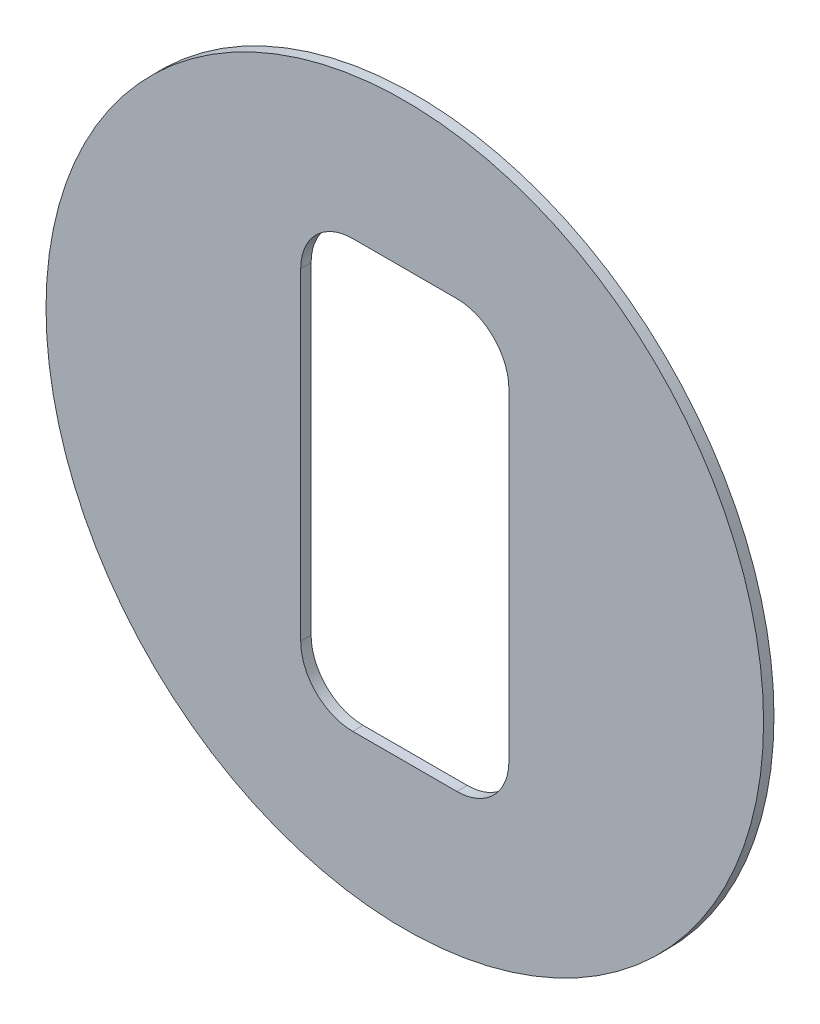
ISO-10303-21;
HEADER;
FILE_DESCRIPTION(('STEP AP214'),'2;1');
FILE_NAME('part.step','',(''),(''),'','','');
FILE_SCHEMA(('AUTOMOTIVE_DESIGN { 1 0 10303 214 1 1 1 1 }'));
ENDSEC;
DATA;
#1=APPLICATION_CONTEXT('core data for automotive mechanical design processes');
#2=APPLICATION_PROTOCOL_DEFINITION('international standard','automotive_design',2000,#1);
#3=PRODUCT_CONTEXT('',#1,'mechanical');
#4=PRODUCT('Part','Part','',(#3));
#5=PRODUCT_RELATED_PRODUCT_CATEGORY('part','',(#4));
#6=PRODUCT_DEFINITION_FORMATION('','',#4);
#7=PRODUCT_DEFINITION_CONTEXT('part definition',#1,'design');
#8=PRODUCT_DEFINITION('design','',#6,#7);
#9=PRODUCT_DEFINITION_SHAPE('','',#8);
#10=(LENGTH_UNIT() NAMED_UNIT(*) SI_UNIT(.MILLI.,.METRE.));
#11=(NAMED_UNIT(*) PLANE_ANGLE_UNIT() SI_UNIT($,.RADIAN.));
#12=(NAMED_UNIT(*) SI_UNIT($,.STERADIAN.) SOLID_ANGLE_UNIT());
#13=UNCERTAINTY_MEASURE_WITH_UNIT(LENGTH_MEASURE(1.E-05),#10,'distance_accuracy_value','');
#14=(GEOMETRIC_REPRESENTATION_CONTEXT(3) GLOBAL_UNCERTAINTY_ASSIGNED_CONTEXT((#13)) GLOBAL_UNIT_ASSIGNED_CONTEXT((#10,
#11,#12)) REPRESENTATION_CONTEXT('',''));
#15=CARTESIAN_POINT('',(0.,0.,0.));
#16=DIRECTION('',(0.,0.,1.));
#17=DIRECTION('',(1.,0.,0.));
#18=AXIS2_PLACEMENT_3D('',#15,#16,#17);
#19=CARTESIAN_POINT('',(0.,0.,-50.));
#20=DIRECTION('',(0.,0.,1.));
#21=DIRECTION('',(1.,0.,0.));
#22=AXIS2_PLACEMENT_3D('',#19,#20,#21);
#23=CYLINDRICAL_SURFACE('',#22,1723.5);
#24=CARTESIAN_POINT('',(0.,0.,-50.));
#25=DIRECTION('',(0.,0.,1.));
#26=DIRECTION('',(1.,0.,0.));
#27=AXIS2_PLACEMENT_3D('',#24,#25,#26);
#28=CIRCLE('',#27,1723.5);
#29=CARTESIAN_POINT('',(1723.5,0.,-50.));
#30=VERTEX_POINT('',#29);
#31=EDGE_CURVE('E11',#30,#30,#28,.T.);
#32=ORIENTED_EDGE('',*,*,#31,.T.);
#33=EDGE_LOOP('',(#32));
#34=FACE_BOUND('',#33,.T.);
#35=CARTESIAN_POINT('',(0.,0.,0.));
#36=DIRECTION('',(0.,0.,1.));
#37=DIRECTION('',(1.,0.,0.));
#38=AXIS2_PLACEMENT_3D('',#35,#36,#37);
#39=CIRCLE('',#38,1723.5);
#40=CARTESIAN_POINT('',(1723.5,0.,0.));
#41=VERTEX_POINT('',#40);
#42=EDGE_CURVE('E42',#41,#41,#39,.T.);
#43=ORIENTED_EDGE('',*,*,#42,.F.);
#44=EDGE_LOOP('',(#43));
#45=FACE_BOUND('',#44,.T.);
#46=ADVANCED_FACE('F39',(#34,#45),#23,.T.);
#47=CARTESIAN_POINT('',(0.,0.,-50.));
#48=DIRECTION('',(0.,0.,1.));
#49=DIRECTION('',(1.,0.,0.));
#50=AXIS2_PLACEMENT_3D('',#47,#48,#49);
#51=PLANE('',#50);
#52=DIRECTION('',(1.,0.,0.));
#53=VECTOR('',#52,1.);
#54=CARTESIAN_POINT('',(249.999999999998,-1025.,-50.));
#55=LINE('',#54,#53);
#56=CARTESIAN_POINT('',(-249.999999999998,-1025.,-50.));
#57=VERTEX_POINT('',#56);
#58=CARTESIAN_POINT('',(249.999999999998,-1025.,-50.));
#59=VERTEX_POINT('',#58);
#60=EDGE_CURVE('E113',#57,#59,#55,.T.);
#61=ORIENTED_EDGE('',*,*,#60,.T.);
#62=CARTESIAN_POINT('',(250.,-775.,-50.));
#63=DIRECTION('',(0.,0.,1.));
#64=DIRECTION('',(1.,0.,0.));
#65=AXIS2_PLACEMENT_3D('',#62,#63,#64);
#66=CIRCLE('',#65,250.);
#67=CARTESIAN_POINT('',(500.,-774.999999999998,-50.));
#68=VERTEX_POINT('',#67);
#69=EDGE_CURVE('E106',#59,#68,#66,.T.);
#70=ORIENTED_EDGE('',*,*,#69,.T.);
#71=DIRECTION('',(0.,1.,0.));
#72=VECTOR('',#71,1.);
#73=CARTESIAN_POINT('',(500.,-774.999999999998,-50.));
#74=LINE('',#73,#72);
#75=CARTESIAN_POINT('',(500.,774.999999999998,-50.));
#76=VERTEX_POINT('',#75);
#77=EDGE_CURVE('E116',#68,#76,#74,.T.);
#78=ORIENTED_EDGE('',*,*,#77,.T.);
#79=CARTESIAN_POINT('',(250.,775.,-50.));
#80=DIRECTION('',(0.,0.,1.));
#81=DIRECTION('',(1.,0.,0.));
#82=AXIS2_PLACEMENT_3D('',#79,#80,#81);
#83=CIRCLE('',#82,250.);
#84=CARTESIAN_POINT('',(249.999999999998,1025.,-50.));
#85=VERTEX_POINT('',#84);
#86=EDGE_CURVE('E54',#76,#85,#83,.T.);
#87=ORIENTED_EDGE('',*,*,#86,.T.);
#88=DIRECTION('',(-1.,0.,0.));
#89=VECTOR('',#88,1.);
#90=CARTESIAN_POINT('',(249.999999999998,1025.,-50.));
#91=LINE('',#90,#89);
#92=CARTESIAN_POINT('',(-249.999999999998,1025.,-50.));
#93=VERTEX_POINT('',#92);
#94=EDGE_CURVE('E135',#85,#93,#91,.T.);
#95=ORIENTED_EDGE('',*,*,#94,.T.);
#96=CARTESIAN_POINT('',(-250.,775.,-50.));
#97=DIRECTION('',(0.,0.,1.));
#98=DIRECTION('',(1.,0.,0.));
#99=AXIS2_PLACEMENT_3D('',#96,#97,#98);
#100=CIRCLE('',#99,250.);
#101=CARTESIAN_POINT('',(-500.,774.999999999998,-50.));
#102=VERTEX_POINT('',#101);
#103=EDGE_CURVE('E139',#93,#102,#100,.T.);
#104=ORIENTED_EDGE('',*,*,#103,.T.);
#105=DIRECTION('',(0.,-1.,0.));
#106=VECTOR('',#105,1.);
#107=CARTESIAN_POINT('',(-500.,-774.999999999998,-50.));
#108=LINE('',#107,#106);
#109=CARTESIAN_POINT('',(-500.,-775.,-50.));
#110=VERTEX_POINT('',#109);
#111=EDGE_CURVE('E143',#102,#110,#108,.T.);
#112=ORIENTED_EDGE('',*,*,#111,.T.);
#113=CARTESIAN_POINT('',(-250.,-775.,-50.));
#114=DIRECTION('',(0.,0.,1.));
#115=DIRECTION('',(-1.,0.,0.));
#116=AXIS2_PLACEMENT_3D('',#113,#114,#115);
#117=CIRCLE('',#116,250.);
#118=EDGE_CURVE('E147',#110,#57,#117,.T.);
#119=ORIENTED_EDGE('',*,*,#118,.T.);
#120=EDGE_LOOP('',(#61,#70,#78,#87,#95,#104,#112,#119));
#121=FACE_BOUND('',#120,.T.);
#122=ORIENTED_EDGE('',*,*,#31,.F.);
#123=EDGE_LOOP('',(#122));
#124=FACE_BOUND('',#123,.T.);
#125=ADVANCED_FACE('F121',(#121,#124),#51,.F.);
#126=CARTESIAN_POINT('',(0.,0.,0.));
#127=DIRECTION('',(0.,0.,1.));
#128=DIRECTION('',(1.,0.,0.));
#129=AXIS2_PLACEMENT_3D('',#126,#127,#128);
#130=PLANE('',#129);
#131=CARTESIAN_POINT('',(250.,-775.,0.));
#132=DIRECTION('',(0.,0.,1.));
#133=DIRECTION('',(1.,0.,0.));
#134=AXIS2_PLACEMENT_3D('',#131,#132,#133);
#135=CIRCLE('',#134,250.);
#136=CARTESIAN_POINT('',(249.999999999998,-1025.,0.));
#137=VERTEX_POINT('',#136);
#138=CARTESIAN_POINT('',(500.,-774.999999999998,0.));
#139=VERTEX_POINT('',#138);
#140=EDGE_CURVE('E62',#137,#139,#135,.T.);
#141=ORIENTED_EDGE('',*,*,#140,.F.);
#142=DIRECTION('',(1.,0.,0.));
#143=VECTOR('',#142,1.);
#144=CARTESIAN_POINT('',(249.999999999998,-1025.,0.));
#145=LINE('',#144,#143);
#146=CARTESIAN_POINT('',(-249.999999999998,-1025.,0.));
#147=VERTEX_POINT('',#146);
#148=EDGE_CURVE('E126',#147,#137,#145,.T.);
#149=ORIENTED_EDGE('',*,*,#148,.F.);
#150=CARTESIAN_POINT('',(-250.,-775.,0.));
#151=DIRECTION('',(0.,0.,1.));
#152=DIRECTION('',(-1.,0.,0.));
#153=AXIS2_PLACEMENT_3D('',#150,#151,#152);
#154=CIRCLE('',#153,250.);
#155=CARTESIAN_POINT('',(-500.,-775.,0.));
#156=VERTEX_POINT('',#155);
#157=EDGE_CURVE('E130',#156,#147,#154,.T.);
#158=ORIENTED_EDGE('',*,*,#157,.F.);
#159=DIRECTION('',(0.,-1.,0.));
#160=VECTOR('',#159,1.);
#161=CARTESIAN_POINT('',(-500.,-774.999999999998,0.));
#162=LINE('',#161,#160);
#163=CARTESIAN_POINT('',(-500.,774.999999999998,0.));
#164=VERTEX_POINT('',#163);
#165=EDGE_CURVE('E169',#164,#156,#162,.T.);
#166=ORIENTED_EDGE('',*,*,#165,.F.);
#167=CARTESIAN_POINT('',(-250.,775.,0.));
#168=DIRECTION('',(0.,0.,1.));
#169=DIRECTION('',(1.,0.,0.));
#170=AXIS2_PLACEMENT_3D('',#167,#168,#169);
#171=CIRCLE('',#170,250.);
#172=CARTESIAN_POINT('',(-249.999999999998,1025.,0.));
#173=VERTEX_POINT('',#172);
#174=EDGE_CURVE('E165',#173,#164,#171,.T.);
#175=ORIENTED_EDGE('',*,*,#174,.F.);
#176=DIRECTION('',(-1.,0.,0.));
#177=VECTOR('',#176,1.);
#178=CARTESIAN_POINT('',(249.999999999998,1025.,0.));
#179=LINE('',#178,#177);
#180=CARTESIAN_POINT('',(249.999999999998,1025.,0.));
#181=VERTEX_POINT('',#180);
#182=EDGE_CURVE('E161',#181,#173,#179,.T.);
#183=ORIENTED_EDGE('',*,*,#182,.F.);
#184=CARTESIAN_POINT('',(250.,775.,0.));
#185=DIRECTION('',(0.,0.,1.));
#186=DIRECTION('',(1.,0.,0.));
#187=AXIS2_PLACEMENT_3D('',#184,#185,#186);
#188=CIRCLE('',#187,250.);
#189=CARTESIAN_POINT('',(500.,774.999999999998,0.));
#190=VERTEX_POINT('',#189);
#191=EDGE_CURVE('E157',#190,#181,#188,.T.);
#192=ORIENTED_EDGE('',*,*,#191,.F.);
#193=DIRECTION('',(0.,1.,0.));
#194=VECTOR('',#193,1.);
#195=CARTESIAN_POINT('',(500.,-774.999999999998,0.));
#196=LINE('',#195,#194);
#197=EDGE_CURVE('E154',#139,#190,#196,.T.);
#198=ORIENTED_EDGE('',*,*,#197,.F.);
#199=EDGE_LOOP('',(#141,#149,#158,#166,#175,#183,#192,#198));
#200=FACE_BOUND('',#199,.T.);
#201=ORIENTED_EDGE('',*,*,#42,.T.);
#202=EDGE_LOOP('',(#201));
#203=FACE_BOUND('',#202,.T.);
#204=ADVANCED_FACE('F199',(#200,#203),#130,.T.);
#205=CARTESIAN_POINT('',(250.,-775.,-50.));
#206=DIRECTION('',(0.,0.,1.));
#207=DIRECTION('',(1.,0.,0.));
#208=AXIS2_PLACEMENT_3D('',#205,#206,#207);
#209=CYLINDRICAL_SURFACE('',#208,250.);
#210=ORIENTED_EDGE('',*,*,#140,.T.);
#211=DIRECTION('',(0.,0.,1.));
#212=VECTOR('',#211,1.);
#213=CARTESIAN_POINT('',(500.,-774.999999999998,-50.));
#214=LINE('',#213,#212);
#215=EDGE_CURVE('E102',#68,#139,#214,.T.);
#216=ORIENTED_EDGE('',*,*,#215,.F.);
#217=ORIENTED_EDGE('',*,*,#69,.F.);
#218=DIRECTION('',(0.,0.,1.));
#219=VECTOR('',#218,1.);
#220=CARTESIAN_POINT('',(249.999999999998,-1025.,-50.));
#221=LINE('',#220,#219);
#222=EDGE_CURVE('E176',#59,#137,#221,.T.);
#223=ORIENTED_EDGE('',*,*,#222,.T.);
#224=EDGE_LOOP('',(#210,#216,#217,#223));
#225=FACE_BOUND('',#224,.T.);
#226=ADVANCED_FACE('F104',(#225),#209,.F.);
#227=CARTESIAN_POINT('',(249.999999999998,-1025.,-50.));
#228=DIRECTION('',(0.,-1.,0.));
#229=DIRECTION('',(1.,0.,0.));
#230=AXIS2_PLACEMENT_3D('',#227,#228,#229);
#231=PLANE('',#230);
#232=ORIENTED_EDGE('',*,*,#148,.T.);
#233=ORIENTED_EDGE('',*,*,#222,.F.);
#234=ORIENTED_EDGE('',*,*,#60,.F.);
#235=DIRECTION('',(0.,0.,1.));
#236=VECTOR('',#235,1.);
#237=CARTESIAN_POINT('',(-249.999999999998,-1025.,-50.));
#238=LINE('',#237,#236);
#239=EDGE_CURVE('E179',#57,#147,#238,.T.);
#240=ORIENTED_EDGE('',*,*,#239,.T.);
#241=EDGE_LOOP('',(#232,#233,#234,#240));
#242=FACE_BOUND('',#241,.T.);
#243=ADVANCED_FACE('F218',(#242),#231,.F.);
#244=CARTESIAN_POINT('',(-250.,-775.,-50.));
#245=DIRECTION('',(0.,0.,1.));
#246=DIRECTION('',(1.,0.,0.));
#247=AXIS2_PLACEMENT_3D('',#244,#245,#246);
#248=CYLINDRICAL_SURFACE('',#247,250.);
#249=ORIENTED_EDGE('',*,*,#157,.T.);
#250=ORIENTED_EDGE('',*,*,#239,.F.);
#251=ORIENTED_EDGE('',*,*,#118,.F.);
#252=DIRECTION('',(0.,0.,1.));
#253=VECTOR('',#252,1.);
#254=CARTESIAN_POINT('',(-500.,-775.,-50.));
#255=LINE('',#254,#253);
#256=EDGE_CURVE('E182',#110,#156,#255,.T.);
#257=ORIENTED_EDGE('',*,*,#256,.T.);
#258=EDGE_LOOP('',(#249,#250,#251,#257));
#259=FACE_BOUND('',#258,.T.);
#260=ADVANCED_FACE('F215',(#259),#248,.F.);
#261=CARTESIAN_POINT('',(-500.,-774.999999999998,-50.));
#262=DIRECTION('',(-1.,0.,0.));
#263=DIRECTION('',(0.,0.,1.));
#264=AXIS2_PLACEMENT_3D('',#261,#262,#263);
#265=PLANE('',#264);
#266=ORIENTED_EDGE('',*,*,#165,.T.);
#267=ORIENTED_EDGE('',*,*,#256,.F.);
#268=ORIENTED_EDGE('',*,*,#111,.F.);
#269=DIRECTION('',(0.,0.,1.));
#270=VECTOR('',#269,1.);
#271=CARTESIAN_POINT('',(-500.,774.999999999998,-50.));
#272=LINE('',#271,#270);
#273=EDGE_CURVE('E185',#102,#164,#272,.T.);
#274=ORIENTED_EDGE('',*,*,#273,.T.);
#275=EDGE_LOOP('',(#266,#267,#268,#274));
#276=FACE_BOUND('',#275,.T.);
#277=ADVANCED_FACE('F211',(#276),#265,.F.);
#278=CARTESIAN_POINT('',(-250.,775.,-50.));
#279=DIRECTION('',(0.,0.,1.));
#280=DIRECTION('',(1.,0.,0.));
#281=AXIS2_PLACEMENT_3D('',#278,#279,#280);
#282=CYLINDRICAL_SURFACE('',#281,250.);
#283=ORIENTED_EDGE('',*,*,#174,.T.);
#284=ORIENTED_EDGE('',*,*,#273,.F.);
#285=ORIENTED_EDGE('',*,*,#103,.F.);
#286=DIRECTION('',(0.,0.,1.));
#287=VECTOR('',#286,1.);
#288=CARTESIAN_POINT('',(-249.999999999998,1025.,-50.));
#289=LINE('',#288,#287);
#290=EDGE_CURVE('E188',#93,#173,#289,.T.);
#291=ORIENTED_EDGE('',*,*,#290,.T.);
#292=EDGE_LOOP('',(#283,#284,#285,#291));
#293=FACE_BOUND('',#292,.T.);
#294=ADVANCED_FACE('F209',(#293),#282,.F.);
#295=CARTESIAN_POINT('',(249.999999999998,1025.,-50.));
#296=DIRECTION('',(0.,1.,0.));
#297=DIRECTION('',(0.,0.,1.));
#298=AXIS2_PLACEMENT_3D('',#295,#296,#297);
#299=PLANE('',#298);
#300=ORIENTED_EDGE('',*,*,#182,.T.);
#301=ORIENTED_EDGE('',*,*,#290,.F.);
#302=ORIENTED_EDGE('',*,*,#94,.F.);
#303=DIRECTION('',(0.,0.,1.));
#304=VECTOR('',#303,1.);
#305=CARTESIAN_POINT('',(249.999999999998,1025.,-50.));
#306=LINE('',#305,#304);
#307=EDGE_CURVE('E191',#85,#181,#306,.T.);
#308=ORIENTED_EDGE('',*,*,#307,.T.);
#309=EDGE_LOOP('',(#300,#301,#302,#308));
#310=FACE_BOUND('',#309,.T.);
#311=ADVANCED_FACE('F204',(#310),#299,.F.);
#312=CARTESIAN_POINT('',(250.,775.,-50.));
#313=DIRECTION('',(0.,0.,1.));
#314=DIRECTION('',(1.,0.,0.));
#315=AXIS2_PLACEMENT_3D('',#312,#313,#314);
#316=CYLINDRICAL_SURFACE('',#315,250.);
#317=ORIENTED_EDGE('',*,*,#191,.T.);
#318=ORIENTED_EDGE('',*,*,#307,.F.);
#319=ORIENTED_EDGE('',*,*,#86,.F.);
#320=DIRECTION('',(0.,0.,1.));
#321=VECTOR('',#320,1.);
#322=CARTESIAN_POINT('',(500.,774.999999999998,-50.));
#323=LINE('',#322,#321);
#324=EDGE_CURVE('E112',#76,#190,#323,.T.);
#325=ORIENTED_EDGE('',*,*,#324,.T.);
#326=EDGE_LOOP('',(#317,#318,#319,#325));
#327=FACE_BOUND('',#326,.T.);
#328=ADVANCED_FACE('F195',(#327),#316,.F.);
#329=CARTESIAN_POINT('',(500.,-774.999999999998,-50.));
#330=DIRECTION('',(1.,0.,0.));
#331=DIRECTION('',(0.,0.,-1.));
#332=AXIS2_PLACEMENT_3D('',#329,#330,#331);
#333=PLANE('',#332);
#334=ORIENTED_EDGE('',*,*,#197,.T.);
#335=ORIENTED_EDGE('',*,*,#324,.F.);
#336=ORIENTED_EDGE('',*,*,#77,.F.);
#337=ORIENTED_EDGE('',*,*,#215,.T.);
#338=EDGE_LOOP('',(#334,#335,#336,#337));
#339=FACE_BOUND('',#338,.T.);
#340=ADVANCED_FACE('F117',(#339),#333,.F.);
#341=CLOSED_SHELL('',(#46,#125,#204,#226,#243,#260,#277,#294,#311,#328,#340));
#342=MANIFOLD_SOLID_BREP('B2',#341);
#343=ADVANCED_BREP_SHAPE_REPRESENTATION('',(#18,#342),#14);
#344=SHAPE_DEFINITION_REPRESENTATION(#9,#343);
ENDSEC;
END-ISO-10303-21;
